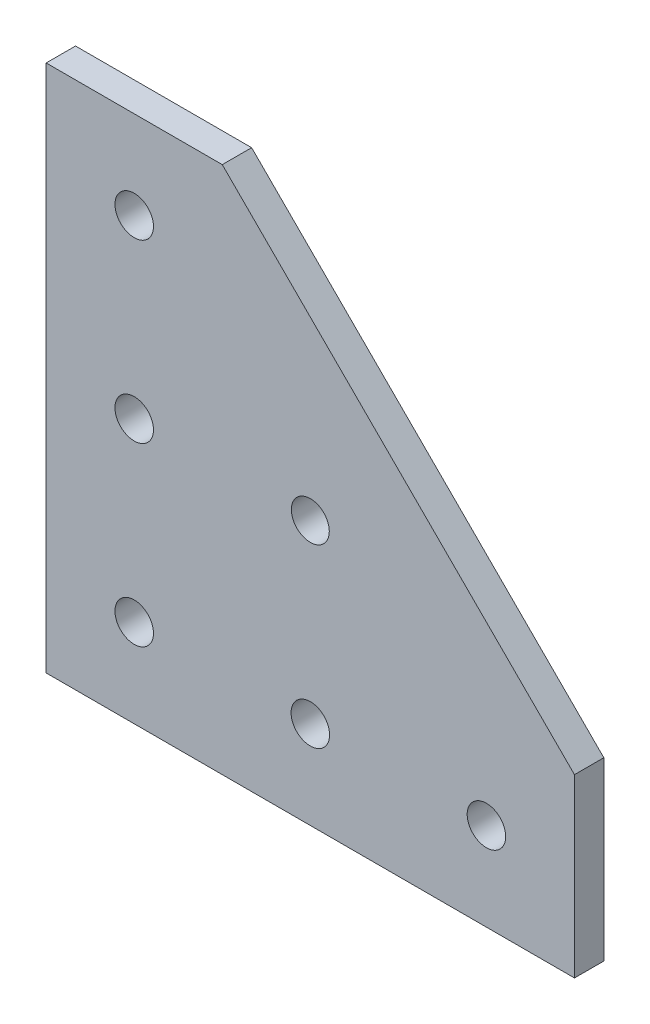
ISO-10303-21;
HEADER;
FILE_DESCRIPTION(('STEP AP214'),'2;1');
FILE_NAME('part.step','',(''),(''),'','','');
FILE_SCHEMA(('AUTOMOTIVE_DESIGN { 1 0 10303 214 1 1 1 1 }'));
ENDSEC;
DATA;
#1=APPLICATION_CONTEXT('core data for automotive mechanical design processes');
#2=APPLICATION_PROTOCOL_DEFINITION('international standard','automotive_design',2000,#1);
#3=PRODUCT_CONTEXT('',#1,'mechanical');
#4=PRODUCT('Part','Part','',(#3));
#5=PRODUCT_RELATED_PRODUCT_CATEGORY('part','',(#4));
#6=PRODUCT_DEFINITION_FORMATION('','',#4);
#7=PRODUCT_DEFINITION_CONTEXT('part definition',#1,'design');
#8=PRODUCT_DEFINITION('design','',#6,#7);
#9=PRODUCT_DEFINITION_SHAPE('','',#8);
#10=(LENGTH_UNIT() NAMED_UNIT(*) SI_UNIT(.MILLI.,.METRE.));
#11=(NAMED_UNIT(*) PLANE_ANGLE_UNIT() SI_UNIT($,.RADIAN.));
#12=(NAMED_UNIT(*) SI_UNIT($,.STERADIAN.) SOLID_ANGLE_UNIT());
#13=UNCERTAINTY_MEASURE_WITH_UNIT(LENGTH_MEASURE(1.E-05),#10,'distance_accuracy_value','');
#14=(GEOMETRIC_REPRESENTATION_CONTEXT(3) GLOBAL_UNCERTAINTY_ASSIGNED_CONTEXT((#13)) GLOBAL_UNIT_ASSIGNED_CONTEXT((#10,
#11,#12)) REPRESENTATION_CONTEXT('',''));
#15=CARTESIAN_POINT('',(0.,0.,0.));
#16=DIRECTION('',(0.,0.,1.));
#17=DIRECTION('',(1.,0.,0.));
#18=AXIS2_PLACEMENT_3D('',#15,#16,#17);
#19=CARTESIAN_POINT('',(0.,0.,3.175));
#20=DIRECTION('',(0.,0.,-1.));
#21=DIRECTION('',(-1.,0.,0.));
#22=AXIS2_PLACEMENT_3D('',#19,#20,#21);
#23=PLANE('',#22);
#24=CARTESIAN_POINT('',(57.15,57.15,3.175));
#25=DIRECTION('',(0.,0.,1.));
#26=DIRECTION('',(1.,0.,0.));
#27=AXIS2_PLACEMENT_3D('',#24,#25,#26);
#28=CIRCLE('',#27,4.10209999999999);
#29=CARTESIAN_POINT('',(61.2521,57.15,3.175));
#30=VERTEX_POINT('',#29);
#31=EDGE_CURVE('E195',#30,#30,#28,.T.);
#32=ORIENTED_EDGE('',*,*,#31,.F.);
#33=EDGE_LOOP('',(#32));
#34=FACE_BOUND('',#33,.T.);
#35=DIRECTION('',(1.,0.,0.));
#36=VECTOR('',#35,1.);
#37=CARTESIAN_POINT('',(114.3,0.,3.175));
#38=LINE('',#37,#36);
#39=CARTESIAN_POINT('',(0.,0.,3.175));
#40=VERTEX_POINT('',#39);
#41=CARTESIAN_POINT('',(114.3,0.,3.175));
#42=VERTEX_POINT('',#41);
#43=EDGE_CURVE('E135',#40,#42,#38,.T.);
#44=ORIENTED_EDGE('',*,*,#43,.T.);
#45=DIRECTION('',(0.,1.,0.));
#46=VECTOR('',#45,1.);
#47=CARTESIAN_POINT('',(114.3,38.1,3.175));
#48=LINE('',#47,#46);
#49=CARTESIAN_POINT('',(114.3,38.1,3.175));
#50=VERTEX_POINT('',#49);
#51=EDGE_CURVE('E92',#42,#50,#48,.T.);
#52=ORIENTED_EDGE('',*,*,#51,.T.);
#53=DIRECTION('',(-0.707106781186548,0.707106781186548,0.));
#54=VECTOR('',#53,1.);
#55=CARTESIAN_POINT('',(114.3,38.1,3.175));
#56=LINE('',#55,#54);
#57=CARTESIAN_POINT('',(38.1,114.3,3.175));
#58=VERTEX_POINT('',#57);
#59=EDGE_CURVE('E96',#50,#58,#56,.T.);
#60=ORIENTED_EDGE('',*,*,#59,.T.);
#61=DIRECTION('',(-1.,0.,0.));
#62=VECTOR('',#61,1.);
#63=CARTESIAN_POINT('',(0.,114.3,3.175));
#64=LINE('',#63,#62);
#65=CARTESIAN_POINT('',(0.,114.3,3.175));
#66=VERTEX_POINT('',#65);
#67=EDGE_CURVE('E100',#58,#66,#64,.T.);
#68=ORIENTED_EDGE('',*,*,#67,.T.);
#69=DIRECTION('',(0.,-1.,0.));
#70=VECTOR('',#69,1.);
#71=CARTESIAN_POINT('',(0.,0.,3.175));
#72=LINE('',#71,#70);
#73=EDGE_CURVE('E58',#66,#40,#72,.T.);
#74=ORIENTED_EDGE('',*,*,#73,.T.);
#75=EDGE_LOOP('',(#44,#52,#60,#68,#74));
#76=FACE_BOUND('',#75,.T.);
#77=CARTESIAN_POINT('',(19.05,19.05,3.175));
#78=DIRECTION('',(0.,0.,1.));
#79=DIRECTION('',(1.,0.,0.));
#80=AXIS2_PLACEMENT_3D('',#77,#78,#79);
#81=CIRCLE('',#80,4.1656);
#82=CARTESIAN_POINT('',(23.2156,19.05,3.175));
#83=VERTEX_POINT('',#82);
#84=EDGE_CURVE('E126',#83,#83,#81,.T.);
#85=ORIENTED_EDGE('',*,*,#84,.F.);
#86=EDGE_LOOP('',(#85));
#87=FACE_BOUND('',#86,.T.);
#88=CARTESIAN_POINT('',(57.15,19.05,3.175));
#89=DIRECTION('',(0.,0.,1.));
#90=DIRECTION('',(1.,0.,0.));
#91=AXIS2_PLACEMENT_3D('',#88,#89,#90);
#92=CIRCLE('',#91,4.1656);
#93=CARTESIAN_POINT('',(61.3156,19.05,3.175));
#94=VERTEX_POINT('',#93);
#95=EDGE_CURVE('E227',#94,#94,#92,.T.);
#96=ORIENTED_EDGE('',*,*,#95,.F.);
#97=EDGE_LOOP('',(#96));
#98=FACE_BOUND('',#97,.T.);
#99=CARTESIAN_POINT('',(95.25,19.05,3.175));
#100=DIRECTION('',(0.,0.,1.));
#101=DIRECTION('',(1.,0.,0.));
#102=AXIS2_PLACEMENT_3D('',#99,#100,#101);
#103=CIRCLE('',#102,4.1656);
#104=CARTESIAN_POINT('',(99.4156,19.05,3.175));
#105=VERTEX_POINT('',#104);
#106=EDGE_CURVE('E219',#105,#105,#103,.T.);
#107=ORIENTED_EDGE('',*,*,#106,.F.);
#108=EDGE_LOOP('',(#107));
#109=FACE_BOUND('',#108,.T.);
#110=CARTESIAN_POINT('',(19.05,95.25,3.175));
#111=DIRECTION('',(0.,0.,1.));
#112=DIRECTION('',(1.,0.,0.));
#113=AXIS2_PLACEMENT_3D('',#110,#111,#112);
#114=CIRCLE('',#113,4.1656);
#115=CARTESIAN_POINT('',(23.2156,95.25,3.175));
#116=VERTEX_POINT('',#115);
#117=EDGE_CURVE('E211',#116,#116,#114,.T.);
#118=ORIENTED_EDGE('',*,*,#117,.F.);
#119=EDGE_LOOP('',(#118));
#120=FACE_BOUND('',#119,.T.);
#121=CARTESIAN_POINT('',(19.05,57.15,3.175));
#122=DIRECTION('',(0.,0.,1.));
#123=DIRECTION('',(1.,0.,0.));
#124=AXIS2_PLACEMENT_3D('',#121,#122,#123);
#125=CIRCLE('',#124,4.1656);
#126=CARTESIAN_POINT('',(23.2156,57.15,3.175));
#127=VERTEX_POINT('',#126);
#128=EDGE_CURVE('E203',#127,#127,#125,.T.);
#129=ORIENTED_EDGE('',*,*,#128,.F.);
#130=EDGE_LOOP('',(#129));
#131=FACE_BOUND('',#130,.T.);
#132=ADVANCED_FACE('F40',(#34,#76,#87,#98,#109,#120,#131),#23,.F.);
#133=CARTESIAN_POINT('',(0.,0.,-3.175));
#134=DIRECTION('',(0.,0.,-1.));
#135=DIRECTION('',(-1.,0.,0.));
#136=AXIS2_PLACEMENT_3D('',#133,#134,#135);
#137=PLANE('',#136);
#138=CARTESIAN_POINT('',(57.15,57.15,-3.17499999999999));
#139=DIRECTION('',(0.,0.,1.));
#140=DIRECTION('',(1.,0.,0.));
#141=AXIS2_PLACEMENT_3D('',#138,#139,#140);
#142=CIRCLE('',#141,4.10209999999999);
#143=CARTESIAN_POINT('',(61.2521,57.15,-3.17499999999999));
#144=VERTEX_POINT('',#143);
#145=EDGE_CURVE('E193',#144,#144,#142,.T.);
#146=ORIENTED_EDGE('',*,*,#145,.T.);
#147=EDGE_LOOP('',(#146));
#148=FACE_BOUND('',#147,.T.);
#149=CARTESIAN_POINT('',(19.05,95.25,-3.175));
#150=DIRECTION('',(0.,0.,1.));
#151=DIRECTION('',(1.,0.,0.));
#152=AXIS2_PLACEMENT_3D('',#149,#150,#151);
#153=CIRCLE('',#152,4.1656);
#154=CARTESIAN_POINT('',(23.2156,95.25,-3.175));
#155=VERTEX_POINT('',#154);
#156=EDGE_CURVE('E207',#155,#155,#153,.T.);
#157=ORIENTED_EDGE('',*,*,#156,.T.);
#158=EDGE_LOOP('',(#157));
#159=FACE_BOUND('',#158,.T.);
#160=CARTESIAN_POINT('',(57.15,19.05,-3.175));
#161=DIRECTION('',(0.,0.,1.));
#162=DIRECTION('',(1.,0.,0.));
#163=AXIS2_PLACEMENT_3D('',#160,#161,#162);
#164=CIRCLE('',#163,4.1656);
#165=CARTESIAN_POINT('',(61.3156,19.05,-3.175));
#166=VERTEX_POINT('',#165);
#167=EDGE_CURVE('E223',#166,#166,#164,.T.);
#168=ORIENTED_EDGE('',*,*,#167,.T.);
#169=EDGE_LOOP('',(#168));
#170=FACE_BOUND('',#169,.T.);
#171=DIRECTION('',(1.,0.,0.));
#172=VECTOR('',#171,1.);
#173=CARTESIAN_POINT('',(114.3,0.,-3.175));
#174=LINE('',#173,#172);
#175=CARTESIAN_POINT('',(0.,0.,-3.175));
#176=VERTEX_POINT('',#175);
#177=CARTESIAN_POINT('',(114.3,0.,-3.175));
#178=VERTEX_POINT('',#177);
#179=EDGE_CURVE('E121',#176,#178,#174,.T.);
#180=ORIENTED_EDGE('',*,*,#179,.F.);
#181=DIRECTION('',(0.,-1.,0.));
#182=VECTOR('',#181,1.);
#183=CARTESIAN_POINT('',(0.,0.,-3.175));
#184=LINE('',#183,#182);
#185=CARTESIAN_POINT('',(0.,114.3,-3.175));
#186=VERTEX_POINT('',#185);
#187=EDGE_CURVE('E84',#186,#176,#184,.T.);
#188=ORIENTED_EDGE('',*,*,#187,.F.);
#189=DIRECTION('',(-1.,0.,0.));
#190=VECTOR('',#189,1.);
#191=CARTESIAN_POINT('',(0.,114.3,-3.175));
#192=LINE('',#191,#190);
#193=CARTESIAN_POINT('',(38.1,114.3,-3.175));
#194=VERTEX_POINT('',#193);
#195=EDGE_CURVE('E78',#194,#186,#192,.T.);
#196=ORIENTED_EDGE('',*,*,#195,.F.);
#197=DIRECTION('',(-0.707106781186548,0.707106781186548,0.));
#198=VECTOR('',#197,1.);
#199=CARTESIAN_POINT('',(114.3,38.1,-3.175));
#200=LINE('',#199,#198);
#201=CARTESIAN_POINT('',(114.3,38.1,-3.175));
#202=VERTEX_POINT('',#201);
#203=EDGE_CURVE('E108',#202,#194,#200,.T.);
#204=ORIENTED_EDGE('',*,*,#203,.F.);
#205=DIRECTION('',(0.,1.,0.));
#206=VECTOR('',#205,1.);
#207=CARTESIAN_POINT('',(114.3,38.1,-3.175));
#208=LINE('',#207,#206);
#209=EDGE_CURVE('E125',#178,#202,#208,.T.);
#210=ORIENTED_EDGE('',*,*,#209,.F.);
#211=EDGE_LOOP('',(#180,#188,#196,#204,#210));
#212=FACE_BOUND('',#211,.T.);
#213=CARTESIAN_POINT('',(19.05,19.05,-3.175));
#214=DIRECTION('',(0.,0.,1.));
#215=DIRECTION('',(1.,0.,0.));
#216=AXIS2_PLACEMENT_3D('',#213,#214,#215);
#217=CIRCLE('',#216,4.1656);
#218=CARTESIAN_POINT('',(23.2156,19.05,-3.175));
#219=VERTEX_POINT('',#218);
#220=EDGE_CURVE('E231',#219,#219,#217,.T.);
#221=ORIENTED_EDGE('',*,*,#220,.T.);
#222=EDGE_LOOP('',(#221));
#223=FACE_BOUND('',#222,.T.);
#224=CARTESIAN_POINT('',(95.25,19.05,-3.175));
#225=DIRECTION('',(0.,0.,1.));
#226=DIRECTION('',(1.,0.,0.));
#227=AXIS2_PLACEMENT_3D('',#224,#225,#226);
#228=CIRCLE('',#227,4.1656);
#229=CARTESIAN_POINT('',(99.4156,19.05,-3.175));
#230=VERTEX_POINT('',#229);
#231=EDGE_CURVE('E215',#230,#230,#228,.T.);
#232=ORIENTED_EDGE('',*,*,#231,.T.);
#233=EDGE_LOOP('',(#232));
#234=FACE_BOUND('',#233,.T.);
#235=CARTESIAN_POINT('',(19.05,57.15,-3.175));
#236=DIRECTION('',(0.,0.,1.));
#237=DIRECTION('',(1.,0.,0.));
#238=AXIS2_PLACEMENT_3D('',#235,#236,#237);
#239=CIRCLE('',#238,4.1656);
#240=CARTESIAN_POINT('',(23.2156,57.15,-3.175));
#241=VERTEX_POINT('',#240);
#242=EDGE_CURVE('E200',#241,#241,#239,.T.);
#243=ORIENTED_EDGE('',*,*,#242,.T.);
#244=EDGE_LOOP('',(#243));
#245=FACE_BOUND('',#244,.T.);
#246=ADVANCED_FACE('F143',(#148,#159,#170,#212,#223,#234,#245),#137,.T.);
#247=CARTESIAN_POINT('',(114.3,0.,3.175));
#248=DIRECTION('',(0.,1.,0.));
#249=DIRECTION('',(-1.,0.,0.));
#250=AXIS2_PLACEMENT_3D('',#247,#248,#249);
#251=PLANE('',#250);
#252=ORIENTED_EDGE('',*,*,#179,.T.);
#253=DIRECTION('',(0.,0.,-1.));
#254=VECTOR('',#253,1.);
#255=CARTESIAN_POINT('',(114.3,0.,3.175));
#256=LINE('',#255,#254);
#257=EDGE_CURVE('E11',#42,#178,#256,.T.);
#258=ORIENTED_EDGE('',*,*,#257,.F.);
#259=ORIENTED_EDGE('',*,*,#43,.F.);
#260=DIRECTION('',(0.,0.,-1.));
#261=VECTOR('',#260,1.);
#262=CARTESIAN_POINT('',(0.,0.,3.175));
#263=LINE('',#262,#261);
#264=EDGE_CURVE('E117',#40,#176,#263,.T.);
#265=ORIENTED_EDGE('',*,*,#264,.T.);
#266=EDGE_LOOP('',(#252,#258,#259,#265));
#267=FACE_BOUND('',#266,.T.);
#268=ADVANCED_FACE('F42',(#267),#251,.F.);
#269=CARTESIAN_POINT('',(114.3,38.1,3.175));
#270=DIRECTION('',(-1.,0.,0.));
#271=DIRECTION('',(0.,0.,1.));
#272=AXIS2_PLACEMENT_3D('',#269,#270,#271);
#273=PLANE('',#272);
#274=ORIENTED_EDGE('',*,*,#209,.T.);
#275=DIRECTION('',(0.,0.,-1.));
#276=VECTOR('',#275,1.);
#277=CARTESIAN_POINT('',(114.3,38.1,3.175));
#278=LINE('',#277,#276);
#279=EDGE_CURVE('E50',#50,#202,#278,.T.);
#280=ORIENTED_EDGE('',*,*,#279,.F.);
#281=ORIENTED_EDGE('',*,*,#51,.F.);
#282=ORIENTED_EDGE('',*,*,#257,.T.);
#283=EDGE_LOOP('',(#274,#280,#281,#282));
#284=FACE_BOUND('',#283,.T.);
#285=ADVANCED_FACE('F324',(#284),#273,.F.);
#286=CARTESIAN_POINT('',(114.3,38.1,3.175));
#287=DIRECTION('',(-0.707106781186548,-0.707106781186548,0.));
#288=DIRECTION('',(0.707106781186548,-0.707106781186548,0.));
#289=AXIS2_PLACEMENT_3D('',#286,#287,#288);
#290=PLANE('',#289);
#291=ORIENTED_EDGE('',*,*,#203,.T.);
#292=DIRECTION('',(0.,0.,-1.));
#293=VECTOR('',#292,1.);
#294=CARTESIAN_POINT('',(38.1,114.3,3.175));
#295=LINE('',#294,#293);
#296=EDGE_CURVE('E105',#58,#194,#295,.T.);
#297=ORIENTED_EDGE('',*,*,#296,.F.);
#298=ORIENTED_EDGE('',*,*,#59,.F.);
#299=ORIENTED_EDGE('',*,*,#279,.T.);
#300=EDGE_LOOP('',(#291,#297,#298,#299));
#301=FACE_BOUND('',#300,.T.);
#302=ADVANCED_FACE('F106',(#301),#290,.F.);
#303=CARTESIAN_POINT('',(0.,114.3,3.175));
#304=DIRECTION('',(0.,-1.,0.));
#305=DIRECTION('',(0.,0.,-1.));
#306=AXIS2_PLACEMENT_3D('',#303,#304,#305);
#307=PLANE('',#306);
#308=ORIENTED_EDGE('',*,*,#195,.T.);
#309=DIRECTION('',(0.,0.,-1.));
#310=VECTOR('',#309,1.);
#311=CARTESIAN_POINT('',(0.,114.3,3.175));
#312=LINE('',#311,#310);
#313=EDGE_CURVE('E110',#66,#186,#312,.T.);
#314=ORIENTED_EDGE('',*,*,#313,.F.);
#315=ORIENTED_EDGE('',*,*,#67,.F.);
#316=ORIENTED_EDGE('',*,*,#296,.T.);
#317=EDGE_LOOP('',(#308,#314,#315,#316));
#318=FACE_BOUND('',#317,.T.);
#319=ADVANCED_FACE('F112',(#318),#307,.F.);
#320=CARTESIAN_POINT('',(0.,0.,3.175));
#321=DIRECTION('',(1.,0.,0.));
#322=DIRECTION('',(0.,0.,-1.));
#323=AXIS2_PLACEMENT_3D('',#320,#321,#322);
#324=PLANE('',#323);
#325=ORIENTED_EDGE('',*,*,#187,.T.);
#326=ORIENTED_EDGE('',*,*,#264,.F.);
#327=ORIENTED_EDGE('',*,*,#73,.F.);
#328=ORIENTED_EDGE('',*,*,#313,.T.);
#329=EDGE_LOOP('',(#325,#326,#327,#328));
#330=FACE_BOUND('',#329,.T.);
#331=ADVANCED_FACE('F148',(#330),#324,.F.);
#332=CARTESIAN_POINT('',(19.05,19.05,3.175));
#333=DIRECTION('',(0.,0.,-1.));
#334=DIRECTION('',(-1.,0.,0.));
#335=AXIS2_PLACEMENT_3D('',#332,#333,#334);
#336=CYLINDRICAL_SURFACE('',#335,4.1656);
#337=ORIENTED_EDGE('',*,*,#84,.T.);
#338=EDGE_LOOP('',(#337));
#339=FACE_BOUND('',#338,.T.);
#340=ORIENTED_EDGE('',*,*,#220,.F.);
#341=EDGE_LOOP('',(#340));
#342=FACE_BOUND('',#341,.T.);
#343=ADVANCED_FACE('F150',(#339,#342),#336,.F.);
#344=CARTESIAN_POINT('',(57.15,19.05,3.175));
#345=DIRECTION('',(0.,0.,-1.));
#346=DIRECTION('',(-1.,0.,0.));
#347=AXIS2_PLACEMENT_3D('',#344,#345,#346);
#348=CYLINDRICAL_SURFACE('',#347,4.1656);
#349=ORIENTED_EDGE('',*,*,#95,.T.);
#350=EDGE_LOOP('',(#349));
#351=FACE_BOUND('',#350,.T.);
#352=ORIENTED_EDGE('',*,*,#167,.F.);
#353=EDGE_LOOP('',(#352));
#354=FACE_BOUND('',#353,.T.);
#355=ADVANCED_FACE('F156',(#351,#354),#348,.F.);
#356=CARTESIAN_POINT('',(95.25,19.05,3.175));
#357=DIRECTION('',(0.,0.,-1.));
#358=DIRECTION('',(-1.,0.,0.));
#359=AXIS2_PLACEMENT_3D('',#356,#357,#358);
#360=CYLINDRICAL_SURFACE('',#359,4.1656);
#361=ORIENTED_EDGE('',*,*,#106,.T.);
#362=EDGE_LOOP('',(#361));
#363=FACE_BOUND('',#362,.T.);
#364=ORIENTED_EDGE('',*,*,#231,.F.);
#365=EDGE_LOOP('',(#364));
#366=FACE_BOUND('',#365,.T.);
#367=ADVANCED_FACE('F172',(#363,#366),#360,.F.);
#368=CARTESIAN_POINT('',(19.05,95.25,3.175));
#369=DIRECTION('',(0.,0.,-1.));
#370=DIRECTION('',(-1.,0.,0.));
#371=AXIS2_PLACEMENT_3D('',#368,#369,#370);
#372=CYLINDRICAL_SURFACE('',#371,4.1656);
#373=ORIENTED_EDGE('',*,*,#117,.T.);
#374=EDGE_LOOP('',(#373));
#375=FACE_BOUND('',#374,.T.);
#376=ORIENTED_EDGE('',*,*,#156,.F.);
#377=EDGE_LOOP('',(#376));
#378=FACE_BOUND('',#377,.T.);
#379=ADVANCED_FACE('F176',(#375,#378),#372,.F.);
#380=CARTESIAN_POINT('',(19.05,57.15,3.175));
#381=DIRECTION('',(0.,0.,-1.));
#382=DIRECTION('',(-1.,0.,0.));
#383=AXIS2_PLACEMENT_3D('',#380,#381,#382);
#384=CYLINDRICAL_SURFACE('',#383,4.1656);
#385=ORIENTED_EDGE('',*,*,#128,.T.);
#386=EDGE_LOOP('',(#385));
#387=FACE_BOUND('',#386,.T.);
#388=ORIENTED_EDGE('',*,*,#242,.F.);
#389=EDGE_LOOP('',(#388));
#390=FACE_BOUND('',#389,.T.);
#391=ADVANCED_FACE('F180',(#387,#390),#384,.F.);
#392=CARTESIAN_POINT('',(57.15,57.15,3.175));
#393=DIRECTION('',(0.,0.,1.));
#394=DIRECTION('',(1.,0.,0.));
#395=AXIS2_PLACEMENT_3D('',#392,#393,#394);
#396=CYLINDRICAL_SURFACE('',#395,4.10209999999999);
#397=ORIENTED_EDGE('',*,*,#145,.F.);
#398=EDGE_LOOP('',(#397));
#399=FACE_BOUND('',#398,.T.);
#400=ORIENTED_EDGE('',*,*,#31,.T.);
#401=EDGE_LOOP('',(#400));
#402=FACE_BOUND('',#401,.T.);
#403=ADVANCED_FACE('F184',(#399,#402),#396,.F.);
#404=CLOSED_SHELL('',(#132,#246,#268,#285,#302,#319,#331,#343,#355,#367,#379,#391,#403));
#405=MANIFOLD_SOLID_BREP('B2',#404);
#406=ADVANCED_BREP_SHAPE_REPRESENTATION('',(#18,#405),#14);
#407=SHAPE_DEFINITION_REPRESENTATION(#9,#406);
ENDSEC;
END-ISO-10303-21;
